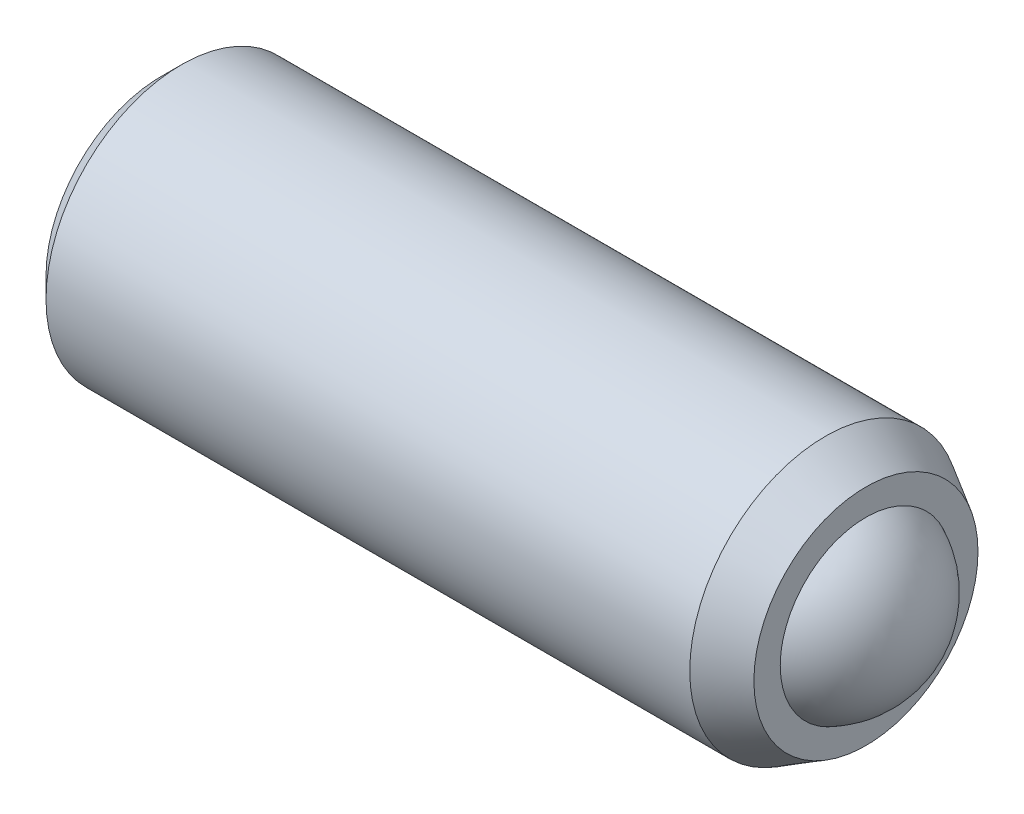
ISO-10303-21;
HEADER;
FILE_DESCRIPTION(('STEP AP214'),'2;1');
FILE_NAME('part.step','',(''),(''),'','','');
FILE_SCHEMA(('AUTOMOTIVE_DESIGN { 1 0 10303 214 1 1 1 1 }'));
ENDSEC;
DATA;
#1=APPLICATION_CONTEXT('core data for automotive mechanical design processes');
#2=APPLICATION_PROTOCOL_DEFINITION('international standard','automotive_design',2000,#1);
#3=PRODUCT_CONTEXT('',#1,'mechanical');
#4=PRODUCT('Part','Part','',(#3));
#5=PRODUCT_RELATED_PRODUCT_CATEGORY('part','',(#4));
#6=PRODUCT_DEFINITION_FORMATION('','',#4);
#7=PRODUCT_DEFINITION_CONTEXT('part definition',#1,'design');
#8=PRODUCT_DEFINITION('design','',#6,#7);
#9=PRODUCT_DEFINITION_SHAPE('','',#8);
#10=(LENGTH_UNIT() NAMED_UNIT(*) SI_UNIT(.MILLI.,.METRE.));
#11=(NAMED_UNIT(*) PLANE_ANGLE_UNIT() SI_UNIT($,.RADIAN.));
#12=(NAMED_UNIT(*) SI_UNIT($,.STERADIAN.) SOLID_ANGLE_UNIT());
#13=UNCERTAINTY_MEASURE_WITH_UNIT(LENGTH_MEASURE(1.E-05),#10,'distance_accuracy_value','');
#14=(GEOMETRIC_REPRESENTATION_CONTEXT(3) GLOBAL_UNCERTAINTY_ASSIGNED_CONTEXT((#13)) GLOBAL_UNIT_ASSIGNED_CONTEXT((#10,
#11,#12)) REPRESENTATION_CONTEXT('',''));
#15=CARTESIAN_POINT('',(0.,0.,0.));
#16=DIRECTION('',(0.,0.,1.));
#17=DIRECTION('',(1.,0.,0.));
#18=AXIS2_PLACEMENT_3D('',#15,#16,#17);
#19=CARTESIAN_POINT('',(12.25,0.,0.));
#20=DIRECTION('',(0.,-1.,0.));
#21=DIRECTION('',(-1.,0.,0.));
#22=AXIS2_PLACEMENT_3D('',#19,#20,#21);
#23=SPHERICAL_SURFACE('',#22,1.75);
#24=CARTESIAN_POINT('',(12.25,-1.75,0.));
#25=VERTEX_POINT('',#24);
#26=VERTEX_LOOP('',#25);
#27=FACE_BOUND('',#26,.T.);
#28=ADVANCED_FACE('P0_F11',(#27),#23,.T.);
#29=CLOSED_SHELL('',(#28));
#30=MANIFOLD_SOLID_BREP('P0_B1',#29);
#31=CARTESIAN_POINT('',(0.,0.,0.));
#32=DIRECTION('',(1.,0.,0.));
#33=DIRECTION('',(0.,0.,-1.));
#34=AXIS2_PLACEMENT_3D('',#31,#32,#33);
#35=PLANE('',#34);
#36=CARTESIAN_POINT('',(0.,0.,0.));
#37=DIRECTION('',(-1.,0.,0.));
#38=DIRECTION('',(0.,0.,1.));
#39=AXIS2_PLACEMENT_3D('',#36,#37,#38);
#40=CIRCLE('',#39,2.125);
#41=CARTESIAN_POINT('',(0.,0.,2.125));
#42=VERTEX_POINT('',#41);
#43=EDGE_CURVE('P1_E10',#42,#42,#40,.T.);
#44=ORIENTED_EDGE('',*,*,#43,.T.);
#45=EDGE_LOOP('',(#44));
#46=FACE_BOUND('',#45,.T.);
#47=ADVANCED_FACE('P1_F15',(#46),#35,.F.);
#48=CARTESIAN_POINT('',(0.375,0.,0.));
#49=DIRECTION('',(1.,0.,0.));
#50=DIRECTION('',(0.,0.,-1.));
#51=AXIS2_PLACEMENT_3D('',#48,#49,#50);
#52=CONICAL_SURFACE('',#51,2.5,0.785398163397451);
#53=ORIENTED_EDGE('',*,*,#43,.F.);
#54=EDGE_LOOP('',(#53));
#55=FACE_BOUND('',#54,.T.);
#56=CARTESIAN_POINT('',(0.375,0.,0.));
#57=DIRECTION('',(-1.,0.,0.));
#58=DIRECTION('',(0.,0.,1.));
#59=AXIS2_PLACEMENT_3D('',#56,#57,#58);
#60=CIRCLE('',#59,2.5);
#61=CARTESIAN_POINT('',(0.375,0.,2.5));
#62=VERTEX_POINT('',#61);
#63=EDGE_CURVE('P1_E21',#62,#62,#60,.T.);
#64=ORIENTED_EDGE('',*,*,#63,.T.);
#65=EDGE_LOOP('',(#64));
#66=FACE_BOUND('',#65,.T.);
#67=ADVANCED_FACE('P1_F39',(#55,#66),#52,.T.);
#68=CARTESIAN_POINT('',(0.,0.,0.));
#69=DIRECTION('',(-1.,0.,0.));
#70=DIRECTION('',(0.,0.,1.));
#71=AXIS2_PLACEMENT_3D('',#68,#69,#70);
#72=CYLINDRICAL_SURFACE('',#71,2.5);
#73=ORIENTED_EDGE('',*,*,#63,.F.);
#74=EDGE_LOOP('',(#73));
#75=FACE_BOUND('',#74,.T.);
#76=CARTESIAN_POINT('',(12.25,0.,0.));
#77=DIRECTION('',(-1.,0.,0.));
#78=DIRECTION('',(0.,0.,1.));
#79=AXIS2_PLACEMENT_3D('',#76,#77,#78);
#80=CIRCLE('',#79,2.5);
#81=CARTESIAN_POINT('',(12.25,0.,2.5));
#82=VERTEX_POINT('',#81);
#83=EDGE_CURVE('P1_E52',#82,#82,#80,.T.);
#84=ORIENTED_EDGE('',*,*,#83,.T.);
#85=EDGE_LOOP('',(#84));
#86=FACE_BOUND('',#85,.T.);
#87=ADVANCED_FACE('P1_F45',(#75,#86),#72,.T.);
#88=CARTESIAN_POINT('',(13.,0.,0.));
#89=DIRECTION('',(-1.,0.,0.));
#90=DIRECTION('',(0.,0.,1.));
#91=AXIS2_PLACEMENT_3D('',#88,#89,#90);
#92=CONICAL_SURFACE('',#91,2.06698729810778,0.5235987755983);
#93=ORIENTED_EDGE('',*,*,#83,.F.);
#94=EDGE_LOOP('',(#93));
#95=FACE_BOUND('',#94,.T.);
#96=CARTESIAN_POINT('',(13.,0.,0.));
#97=DIRECTION('',(-1.,0.,0.));
#98=DIRECTION('',(0.,0.,1.));
#99=AXIS2_PLACEMENT_3D('',#96,#97,#98);
#100=CIRCLE('',#99,2.06698729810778);
#101=CARTESIAN_POINT('',(13.,0.,2.06698729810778));
#102=VERTEX_POINT('',#101);
#103=EDGE_CURVE('P1_E54',#102,#102,#100,.T.);
#104=ORIENTED_EDGE('',*,*,#103,.T.);
#105=EDGE_LOOP('',(#104));
#106=FACE_BOUND('',#105,.T.);
#107=ADVANCED_FACE('P1_F78',(#95,#106),#92,.T.);
#108=CARTESIAN_POINT('',(13.,2.06698729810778,0.));
#109=DIRECTION('',(-1.,0.,0.));
#110=DIRECTION('',(0.,0.,1.));
#111=AXIS2_PLACEMENT_3D('',#108,#109,#110);
#112=PLANE('',#111);
#113=ORIENTED_EDGE('',*,*,#103,.F.);
#114=EDGE_LOOP('',(#113));
#115=FACE_BOUND('',#114,.T.);
#116=CARTESIAN_POINT('',(13.,0.,0.));
#117=DIRECTION('',(-1.,0.,0.));
#118=DIRECTION('',(0.,0.,1.));
#119=AXIS2_PLACEMENT_3D('',#116,#117,#118);
#120=CIRCLE('',#119,1.58113883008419);
#121=CARTESIAN_POINT('',(13.,0.,1.58113883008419));
#122=VERTEX_POINT('',#121);
#123=EDGE_CURVE('P1_E59',#122,#122,#120,.T.);
#124=ORIENTED_EDGE('',*,*,#123,.T.);
#125=EDGE_LOOP('',(#124));
#126=FACE_BOUND('',#125,.T.);
#127=ADVANCED_FACE('P1_F71',(#115,#126),#112,.F.);
#128=CARTESIAN_POINT('',(12.25,0.,0.));
#129=DIRECTION('',(-1.,0.,0.));
#130=DIRECTION('',(0.,1.,0.));
#131=AXIS2_PLACEMENT_3D('',#128,#129,#130);
#132=SPHERICAL_SURFACE('',#131,1.75);
#133=ORIENTED_EDGE('',*,*,#123,.F.);
#134=EDGE_LOOP('',(#133));
#135=FACE_BOUND('',#134,.T.);
#136=CARTESIAN_POINT('',(12.25,0.,0.));
#137=DIRECTION('',(-1.,0.,0.));
#138=DIRECTION('',(0.,0.,1.));
#139=AXIS2_PLACEMENT_3D('',#136,#137,#138);
#140=CIRCLE('',#139,1.75);
#141=CARTESIAN_POINT('',(12.25,0.,1.75));
#142=VERTEX_POINT('',#141);
#143=EDGE_CURVE('P1_E62',#142,#142,#140,.T.);
#144=ORIENTED_EDGE('',*,*,#143,.T.);
#145=EDGE_LOOP('',(#144));
#146=FACE_BOUND('',#145,.T.);
#147=ADVANCED_FACE('P1_F34',(#135,#146),#132,.F.);
#148=CARTESIAN_POINT('',(0.,0.,0.));
#149=DIRECTION('',(-1.,0.,0.));
#150=DIRECTION('',(0.,0.,1.));
#151=AXIS2_PLACEMENT_3D('',#148,#149,#150);
#152=CYLINDRICAL_SURFACE('',#151,1.75);
#153=ORIENTED_EDGE('',*,*,#143,.F.);
#154=EDGE_LOOP('',(#153));
#155=FACE_BOUND('',#154,.T.);
#156=CARTESIAN_POINT('',(2.63536297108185,0.,0.));
#157=DIRECTION('',(-1.,0.,0.));
#158=DIRECTION('',(0.,0.,1.));
#159=AXIS2_PLACEMENT_3D('',#156,#157,#158);
#160=CIRCLE('',#159,1.75);
#161=CARTESIAN_POINT('',(2.63536297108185,0.,1.75));
#162=VERTEX_POINT('',#161);
#163=EDGE_CURVE('P1_E65',#162,#162,#160,.T.);
#164=ORIENTED_EDGE('',*,*,#163,.T.);
#165=EDGE_LOOP('',(#164));
#166=FACE_BOUND('',#165,.T.);
#167=ADVANCED_FACE('P1_F26',(#155,#166),#152,.F.);
#168=CARTESIAN_POINT('',(1.625,0.,0.));
#169=DIRECTION('',(1.,0.,0.));
#170=DIRECTION('',(0.,0.,-1.));
#171=AXIS2_PLACEMENT_3D('',#168,#169,#170);
#172=CONICAL_SURFACE('',#171,0.,1.0471975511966);
#173=ORIENTED_EDGE('',*,*,#163,.F.);
#174=EDGE_LOOP('',(#173));
#175=FACE_BOUND('',#174,.T.);
#176=CARTESIAN_POINT('',(1.625,0.,0.));
#177=VERTEX_POINT('',#176);
#178=VERTEX_LOOP('',#177);
#179=FACE_BOUND('',#178,.T.);
#180=ADVANCED_FACE('P1_F24',(#175,#179),#172,.F.);
#181=CLOSED_SHELL('',(#47,#67,#87,#107,#127,#147,#167,#180));
#182=MANIFOLD_SOLID_BREP('P1_B1',#181);
#183=ADVANCED_BREP_SHAPE_REPRESENTATION('',(#18,#30,#182),#14);
#184=SHAPE_DEFINITION_REPRESENTATION(#9,#183);
ENDSEC;
END-ISO-10303-21;
